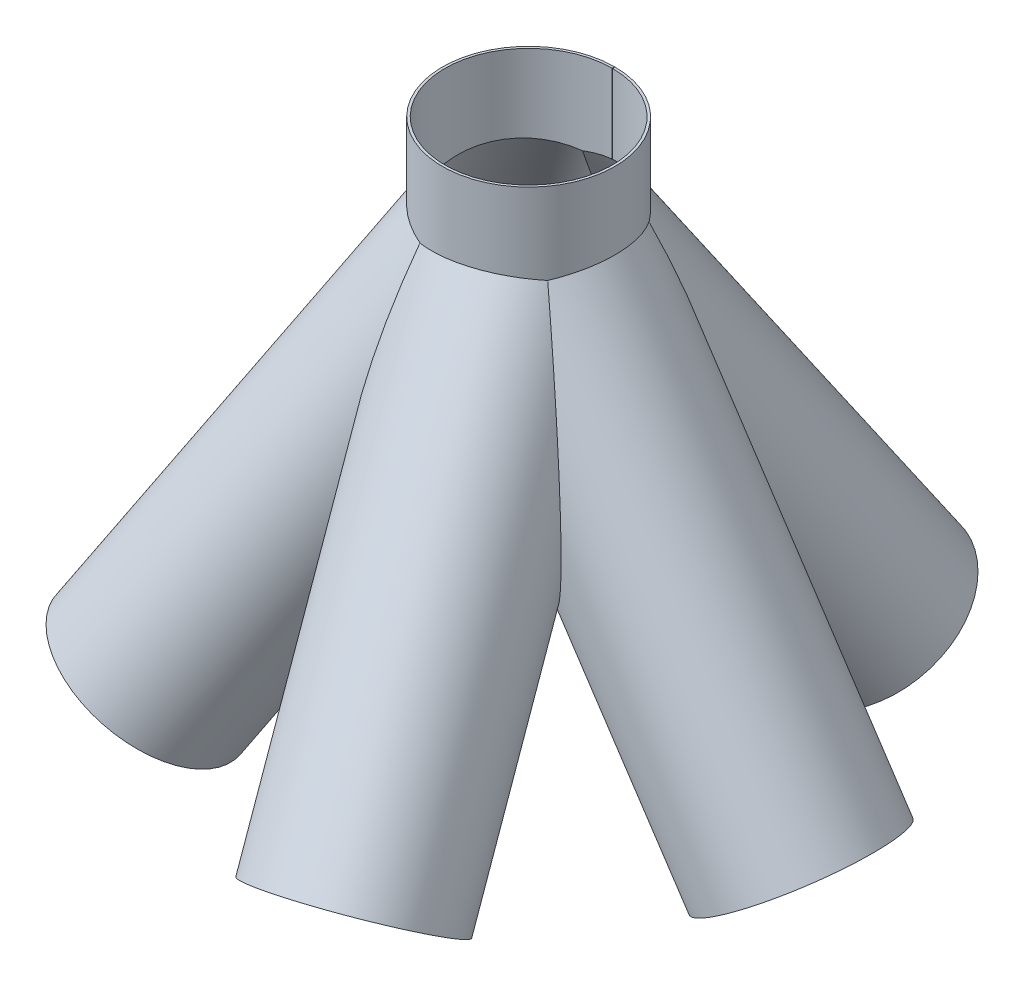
from build123d import *

# Parameters (mm, degrees)
SKETCH_2_R               = 210
SKETCH_2_R_2             = 204
EXTRUDE_1_DEPTH          = 250
SKETCH_3_R               = 210
SKETCH_3_R_2             = 204
EXTRUDE_2_DEPTH          = 1200
CUT_EXTRUDE_1_DEPTH      = 1412.569151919
CUT_EXTRUDE_1_DEPTH_BACK = 1412.569151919
CUT_EXTRUDE_2_DEPTH      = 1412.569151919
CUT_EXTRUDE_2_DEPTH_BACK = 1412.569151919
CUT_EXTRUDE_3_DEPTH      = 1412.569151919
CUT_EXTRUDE_3_DEPTH_BACK = 1412.569151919
CUT_EXTRUDE_4_DEPTH      = 1412.569151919
CUT_EXTRUDE_4_DEPTH_BACK = 1412.569151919
CUT_EXTRUDE_5_DEPTH      = 1412.569151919
CUT_EXTRUDE_5_DEPTH_BACK = 1412.569151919
CUT_EXTRUDE_6_DEPTH      = 1412.569151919
CUT_EXTRUDE_6_DEPTH_BACK = 1412.569151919
CUT_EXTRUDE_7_DEPTH      = 1412.569151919
CUT_EXTRUDE_7_DEPTH_BACK = 1412.569151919
CUT_EXTRUDE_8_DEPTH      = 1412.569151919
CUT_EXTRUDE_8_DEPTH_BACK = 1412.569151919
SKETCH_1_W               = 1
SKETCH_1_H               = 1366.081867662
CUT_EXTRUDE_3_2_DEPTH    = 1412.569151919
SKETCH_4_W               = 210
SKETCH_4_H               = 1
CUT_EXTRUDE_2_2_DEPTH    = 1540.251922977
PATTERN_CIRCULAR_1_COUNT = 5


with BuildPart() as part:
    # Sketch 2 → Extrude 1 (new body)
    with BuildSketch(Plane(origin=(0, 0, 0), x_dir=(1, 0, 0), z_dir=(0, 1, 0))):
        Circle(SKETCH_2_R)
        Circle(SKETCH_2_R_2, mode=Mode.SUBTRACT)
    extrude(amount=EXTRUDE_1_DEPTH)

    # Sketch 5 → Cut-Extrude 1 (cut, two sides: drawn at the far end of the back side and taken through both)
    with BuildSketch(Plane.XY.offset(-CUT_EXTRUDE_1_DEPTH_BACK)):
        Polygon((3064.469176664, 923.972221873), (210, 63.317382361), (-210, -63.317382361), (-3064.469176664, -923.972221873), (-1343.15949764, -6632.9105752), (4785.778855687, -4784.966131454), align=None)
    extrude(amount=CUT_EXTRUDE_1_DEPTH + CUT_EXTRUDE_1_DEPTH_BACK, mode=Mode.SUBTRACT)

    # Sketch 8 → Cut-Extrude 5 (cut, two sides: drawn at the far end of the back side and taken through both)
    with BuildSketch(Plane(origin=(0, 0, 0), x_dir=(0.3090169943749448, 0, 0.9510565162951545), z_dir=(-0.9510565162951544, 0, 0.30901699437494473)).offset(-CUT_EXTRUDE_5_DEPTH_BACK)):
        Polygon((2653.957591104, 800.198321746), (210, 63.317382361), (-210, -63.317382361), (-2653.957591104, -800.198321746), (-1180.195712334, -5688.113503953), (4127.719469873, -4087.716860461), align=None)
    extrude(amount=CUT_EXTRUDE_5_DEPTH + CUT_EXTRUDE_5_DEPTH_BACK, mode=Mode.SUBTRACT)

    # Sketch 9 → Cut-Extrude 6 (cut, two sides: drawn at the far end of the back side and taken through both)
    with BuildSketch(Plane(origin=(0, 0, 0), x_dir=(-0.8090169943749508, 0, 0.5877852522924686), z_dir=(-0.5877852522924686, 0, -0.8090169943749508)).offset(-CUT_EXTRUDE_6_DEPTH_BACK)):
        Polygon((3194.956116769, 963.315514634), (210, 63.317382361), (-210, -63.317382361), (-3194.956116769, -963.315514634), (-1394.959852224, -6933.227748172), (4994.952381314, -5006.596718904), align=None)
    extrude(amount=CUT_EXTRUDE_6_DEPTH + CUT_EXTRUDE_6_DEPTH_BACK, mode=Mode.SUBTRACT)

    # Sketch 10 → Cut-Extrude 7 (cut, two sides: drawn at the far end of the back side and taken through both)
    with BuildSketch(Plane(origin=(0, 0, 0), x_dir=(-0.8090169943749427, 0, -0.5877852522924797), z_dir=(0.5877852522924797, 0, -0.8090169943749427)).offset(-CUT_EXTRUDE_7_DEPTH_BACK)):
        Polygon((3194.956116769, 963.315514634), (210, 63.317382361), (-210, -63.317382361), (-3194.956116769, -963.315514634), (-1394.959852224, -6933.227748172), (4994.952381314, -5006.596718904), align=None)
    extrude(amount=CUT_EXTRUDE_7_DEPTH + CUT_EXTRUDE_7_DEPTH_BACK, mode=Mode.SUBTRACT)

    # Sketch 11 → Cut-Extrude 8 (cut, two sides: drawn at the far end of the back side and taken through both)
    with BuildSketch(Plane(origin=(0, 0, 0), x_dir=(0.3090169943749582, 0, -0.9510565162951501), z_dir=(0.9510565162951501, 0, 0.3090169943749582)).offset(-CUT_EXTRUDE_8_DEPTH_BACK)):
        Polygon((2653.957591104, 800.198321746), (210, 63.317382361), (-210, -63.317382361), (-2653.957591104, -800.198321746), (-1180.195712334, -5688.113503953), (4127.719469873, -4087.716860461), align=None)
    extrude(amount=CUT_EXTRUDE_8_DEPTH + CUT_EXTRUDE_8_DEPTH_BACK, mode=Mode.SUBTRACT)

    # Sketch 1 → Cut-Extrude 3 2 (cut, through all)
    with BuildSketch(Plane.XY):
        with Locations((0, -433.040933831)):
            Rectangle(SKETCH_1_W, SKETCH_1_H)
    extrude(amount=-CUT_EXTRUDE_3_2_DEPTH, mode=Mode.SUBTRACT)


with BuildPart() as body_2:
    # Sketch 3 → Extrude 2 (new body)
    with BuildSketch(Plane(origin=(663.324958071, -1000, 0), x_dir=(0.8333333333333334, 0.5527707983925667, 0), z_dir=(0.5527707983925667, -0.8333333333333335, 0))):
        Circle(SKETCH_3_R)
        Circle(SKETCH_3_R_2, mode=Mode.SUBTRACT)
    extrude(amount=-EXTRUDE_2_DEPTH)

    # Sketch 5_2 → Cut-Extrude 2 (cut, two sides: drawn at the far end of the back side and taken through both)
    with BuildSketch(Plane.XY.offset(-CUT_EXTRUDE_2_DEPTH_BACK)):
        Polygon((3064.469176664, 923.972221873), (210, 63.317382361), (-210, -63.317382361), (-3064.469176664, -923.972221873), (-4785.778855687, 4784.966131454), (1343.15949764, 6632.9105752), align=None)
    extrude(amount=CUT_EXTRUDE_2_DEPTH + CUT_EXTRUDE_2_DEPTH_BACK, mode=Mode.SUBTRACT)

    # Sketch 6 → Cut-Extrude 3 (cut, two sides: drawn at the far end of the back side and taken through both)
    with BuildSketch(Plane(origin=(0, 0, 0), x_dir=(-0.587785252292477, 0, 0.8090169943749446), z_dir=(-0.8090169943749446, 0, -0.587785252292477)).offset(-CUT_EXTRUDE_3_DEPTH_BACK)):
        Polygon((0, -4162.713460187), (0, -1116.081867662), (0, 250), (0, 3296.631592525), (6093.26318505, 3296.631592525), (6093.26318505, -4162.713460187), align=None)
    extrude(amount=CUT_EXTRUDE_3_DEPTH + CUT_EXTRUDE_3_DEPTH_BACK, mode=Mode.SUBTRACT)

    # Sketch 7 → Cut-Extrude 4 (cut, two sides: drawn at the far end of the back side and taken through both)
    with BuildSketch(Plane(origin=(0, 0, 0), x_dir=(-0.5877852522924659, 0, -0.8090169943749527), z_dir=(0.8090169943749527, 0, -0.5877852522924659)).offset(-CUT_EXTRUDE_4_DEPTH_BACK)):
        Polygon((0, 3307.432912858), (0, 250), (0, -1122.081867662), (0, -4179.51478052), (6114.865825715, -4179.51478052), (6114.865825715, 3307.432912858), align=None)
    extrude(amount=CUT_EXTRUDE_4_DEPTH + CUT_EXTRUDE_4_DEPTH_BACK, mode=Mode.SUBTRACT)

    # Sketch 4 → Cut-Extrude 2 2 (cut, through all)
    with BuildSketch(Plane(origin=(663.324958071, -1000, 0), x_dir=(0.8333333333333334, 0.5527707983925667, 0), z_dir=(0.5527707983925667, -0.8333333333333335, 0))):
        with Locations((-105, 0)):
            Rectangle(SKETCH_4_W, SKETCH_4_H)
    extrude(amount=-CUT_EXTRUDE_2_2_DEPTH, mode=Mode.SUBTRACT)


with BuildPart() as pattern_circular_1_1:
    # Pattern Circular 1: pattern copy
    add(body_2.part.rotate(Axis((0, 0, 0), (0, 1, 0)), 1 * 360 / PATTERN_CIRCULAR_1_COUNT))


with BuildPart() as pattern_circular_1_2:
    # Pattern Circular 1: pattern copy
    add(body_2.part.rotate(Axis((0, 0, 0), (0, 1, 0)), 2 * 360 / PATTERN_CIRCULAR_1_COUNT))


with BuildPart() as pattern_circular_1_3:
    # Pattern Circular 1: pattern copy
    add(body_2.part.rotate(Axis((0, 0, 0), (0, 1, 0)), 3 * 360 / PATTERN_CIRCULAR_1_COUNT))


with BuildPart() as pattern_circular_1_4:
    # Pattern Circular 1: pattern copy
    add(body_2.part.rotate(Axis((0, 0, 0), (0, 1, 0)), 4 * 360 / PATTERN_CIRCULAR_1_COUNT))


solid = Compound([part.part, body_2.part, pattern_circular_1_1.part, pattern_circular_1_2.part, pattern_circular_1_3.part, pattern_circular_1_4.part])
